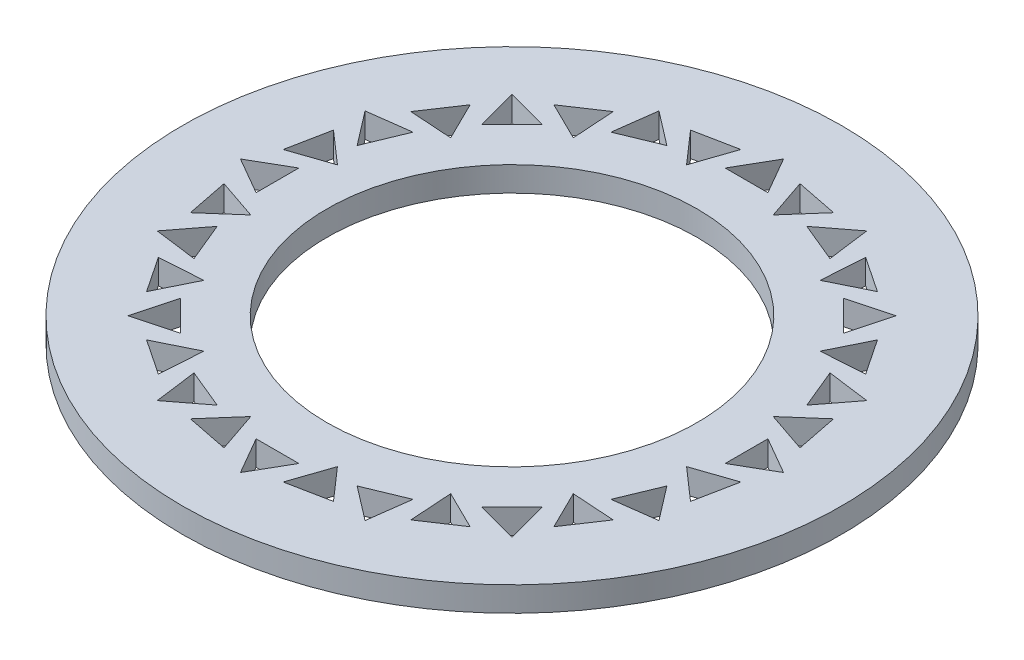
from build123d import *

# Parameters (mm, degrees)
SKETCH1_R           = 13.35
SKETCH1_R_2         = 7.5
BOSS_EXTRUDE1_DEPTH = 1
CUT_EXTRUDE1_DEPTH  = 3


with BuildPart() as part:
    # Sketch1 → Boss-Extrude1 (new body)
    with BuildSketch(Plane(origin=(0, 0, 0), x_dir=(1, 0, 0), z_dir=(0, 1, 0))):
        with Locations(Location((0, 0, 0), (0, 0, 270))):
            Circle(SKETCH1_R)
        with Locations(Location((0, 0, 0), (0, 0, 270))):
            Circle(SKETCH1_R_2, mode=Mode.SUBTRACT)
    extrude(amount=BOSS_EXTRUDE1_DEPTH)

    # Sketch3 → Cut-Extrude1 (cut)
    with BuildSketch(Plane(origin=(0, 1, 0), x_dir=(1, 0, 0), z_dir=(0, 1, 0))):
        Polygon((4.209517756, 10.162674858), (2.835389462, 9.108269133), (4.435595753, 8.445441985), align=None)
        Polygon((0, 11), (-0.866025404, 9.5), (0.866025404, 9.5), align=None)
        Polygon((7.778174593, 7.778174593), (6.105141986, 7.329886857), (7.329886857, 6.105141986), align=None)
        Polygon((10.162674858, 4.209517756), (8.445441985, 4.435595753), (9.108269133, 2.835389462), align=None)
        Polygon((11, 0), (9.5, 0.866025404), (9.5, -0.866025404), align=None)
        Polygon((10.162674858, -4.209517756), (9.108269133, -2.835389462), (8.445441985, -4.435595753), align=None)
        Polygon((7.778174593, -7.778174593), (7.329886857, -6.105141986), (6.105141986, -7.329886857), align=None)
        Polygon((4.209517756, -10.162674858), (4.435595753, -8.445441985), (2.835389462, -9.108269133), align=None)
        Polygon((0, -11), (0.866025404, -9.5), (-0.866025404, -9.5), align=None)
        Polygon((-4.209517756, -10.162674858), (-2.835389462, -9.108269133), (-4.435595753, -8.445441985), align=None)
        Polygon((-7.778174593, -7.778174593), (-6.105141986, -7.329886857), (-7.329886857, -6.105141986), align=None)
        Polygon((-10.162674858, -4.209517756), (-8.445441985, -4.435595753), (-9.108269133, -2.835389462), align=None)
        Polygon((-11, 0), (-9.5, -0.866025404), (-9.5, 0.866025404), align=None)
        Polygon((-10.162674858, 4.209517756), (-9.108269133, 2.835389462), (-8.445441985, 4.435595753), align=None)
        Polygon((-7.778174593, 7.778174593), (-7.329886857, 6.105141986), (-6.105141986, 7.329886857), align=None)
        Polygon((-4.209517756, 10.162674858), (-4.435595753, 8.445441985), (-2.835389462, 9.108269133), align=None)
        Polygon((5.000132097, 7.483226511), (6.553561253, 8.249292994), (5.11341364, 9.211568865), align=None)
        Polygon((1.755812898, 8.827067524), (2.89783335, 10.129292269), (1.199063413, 10.467198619), align=None)
        Polygon((7.483226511, 5.000132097), (9.211568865, 5.11341364), (8.249292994, 6.553561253), align=None)
        Polygon((8.827067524, 1.755812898), (10.467198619, 1.199063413), (10.129292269, 2.89783335), align=None)
        Polygon((8.827067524, -1.755812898), (10.129292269, -2.89783335), (10.467198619, -1.199063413), align=None)
        Polygon((7.483226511, -5.000132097), (8.249292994, -6.553561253), (9.211568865, -5.11341364), align=None)
        Polygon((5.000132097, -7.483226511), (5.11341364, -9.211568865), (6.553561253, -8.249292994), align=None)
        Polygon((1.755812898, -8.827067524), (1.199063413, -10.467198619), (2.89783335, -10.129292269), align=None)
        Polygon((-1.755812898, -8.827067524), (-2.89783335, -10.129292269), (-1.199063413, -10.467198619), align=None)
        Polygon((-5.000132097, -7.483226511), (-6.553561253, -8.249292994), (-5.11341364, -9.211568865), align=None)
        Polygon((-7.483226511, -5.000132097), (-9.211568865, -5.11341364), (-8.249292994, -6.553561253), align=None)
        Polygon((-8.827067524, -1.755812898), (-10.467198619, -1.199063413), (-10.129292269, -2.89783335), align=None)
        Polygon((-8.827067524, 1.755812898), (-10.129292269, 2.89783335), (-10.467198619, 1.199063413), align=None)
        Polygon((-7.483226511, 5.000132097), (-8.249292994, 6.553561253), (-9.211568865, 5.11341364), align=None)
        Polygon((-5.000132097, 7.483226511), (-5.11341364, 9.211568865), (-6.553561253, 8.249292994), align=None)
        Polygon((-1.755812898, 8.827067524), (-1.199063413, 10.467198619), (-2.89783335, 10.129292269), align=None)
    extrude(amount=-CUT_EXTRUDE1_DEPTH, mode=Mode.SUBTRACT)


solid = part.part
